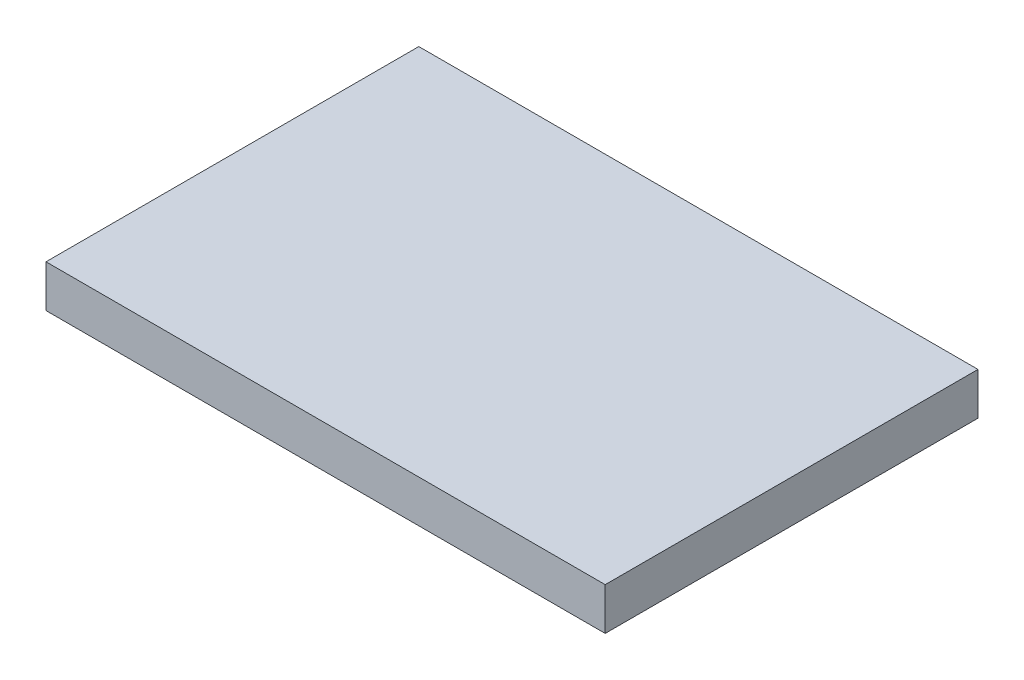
ISO-10303-21;
HEADER;
FILE_DESCRIPTION(('STEP AP214'),'2;1');
FILE_NAME('part.step','',(''),(''),'','','');
FILE_SCHEMA(('AUTOMOTIVE_DESIGN { 1 0 10303 214 1 1 1 1 }'));
ENDSEC;
DATA;
#1=APPLICATION_CONTEXT('core data for automotive mechanical design processes');
#2=APPLICATION_PROTOCOL_DEFINITION('international standard','automotive_design',2000,#1);
#3=PRODUCT_CONTEXT('',#1,'mechanical');
#4=PRODUCT('Part','Part','',(#3));
#5=PRODUCT_RELATED_PRODUCT_CATEGORY('part','',(#4));
#6=PRODUCT_DEFINITION_FORMATION('','',#4);
#7=PRODUCT_DEFINITION_CONTEXT('part definition',#1,'design');
#8=PRODUCT_DEFINITION('design','',#6,#7);
#9=PRODUCT_DEFINITION_SHAPE('','',#8);
#10=(LENGTH_UNIT() NAMED_UNIT(*) SI_UNIT(.MILLI.,.METRE.));
#11=(NAMED_UNIT(*) PLANE_ANGLE_UNIT() SI_UNIT($,.RADIAN.));
#12=(NAMED_UNIT(*) SI_UNIT($,.STERADIAN.) SOLID_ANGLE_UNIT());
#13=UNCERTAINTY_MEASURE_WITH_UNIT(LENGTH_MEASURE(1.E-05),#10,'distance_accuracy_value','');
#14=(GEOMETRIC_REPRESENTATION_CONTEXT(3) GLOBAL_UNCERTAINTY_ASSIGNED_CONTEXT((#13)) GLOBAL_UNIT_ASSIGNED_CONTEXT((#10,
#11,#12)) REPRESENTATION_CONTEXT('',''));
#15=CARTESIAN_POINT('',(0.,0.,0.));
#16=DIRECTION('',(0.,0.,1.));
#17=DIRECTION('',(1.,0.,0.));
#18=AXIS2_PLACEMENT_3D('',#15,#16,#17);
#19=CARTESIAN_POINT('',(0.,6.35,0.));
#20=DIRECTION('',(1.,0.,0.));
#21=DIRECTION('',(0.,0.,-1.));
#22=AXIS2_PLACEMENT_3D('',#19,#20,#21);
#23=PLANE('',#22);
#24=DIRECTION('',(0.,0.,1.));
#25=VECTOR('',#24,1.);
#26=CARTESIAN_POINT('',(0.,0.,0.));
#27=LINE('',#26,#25);
#28=CARTESIAN_POINT('',(0.,0.,-56.));
#29=VERTEX_POINT('',#28);
#30=CARTESIAN_POINT('',(0.,0.,0.));
#31=VERTEX_POINT('',#30);
#32=EDGE_CURVE('E105',#29,#31,#27,.T.);
#33=ORIENTED_EDGE('',*,*,#32,.T.);
#34=DIRECTION('',(0.,-1.,0.));
#35=VECTOR('',#34,1.);
#36=CARTESIAN_POINT('',(0.,6.35,0.));
#37=LINE('',#36,#35);
#38=CARTESIAN_POINT('',(0.,6.35,0.));
#39=VERTEX_POINT('',#38);
#40=EDGE_CURVE('E11',#39,#31,#37,.T.);
#41=ORIENTED_EDGE('',*,*,#40,.F.);
#42=DIRECTION('',(0.,0.,1.));
#43=VECTOR('',#42,1.);
#44=CARTESIAN_POINT('',(0.,6.35,0.));
#45=LINE('',#44,#43);
#46=CARTESIAN_POINT('',(0.,6.35,-56.));
#47=VERTEX_POINT('',#46);
#48=EDGE_CURVE('E89',#47,#39,#45,.T.);
#49=ORIENTED_EDGE('',*,*,#48,.F.);
#50=DIRECTION('',(0.,-1.,0.));
#51=VECTOR('',#50,1.);
#52=CARTESIAN_POINT('',(0.,6.35,-56.));
#53=LINE('',#52,#51);
#54=EDGE_CURVE('E97',#47,#29,#53,.T.);
#55=ORIENTED_EDGE('',*,*,#54,.T.);
#56=EDGE_LOOP('',(#33,#41,#49,#55));
#57=FACE_BOUND('',#56,.T.);
#58=ADVANCED_FACE('F39',(#57),#23,.F.);
#59=CARTESIAN_POINT('',(0.,6.35,0.));
#60=DIRECTION('',(0.,0.,-1.));
#61=DIRECTION('',(-1.,0.,0.));
#62=AXIS2_PLACEMENT_3D('',#59,#60,#61);
#63=PLANE('',#62);
#64=DIRECTION('',(1.,0.,0.));
#65=VECTOR('',#64,1.);
#66=CARTESIAN_POINT('',(0.,0.,0.));
#67=LINE('',#66,#65);
#68=CARTESIAN_POINT('',(84.,0.,0.));
#69=VERTEX_POINT('',#68);
#70=EDGE_CURVE('E92',#31,#69,#67,.T.);
#71=ORIENTED_EDGE('',*,*,#70,.T.);
#72=DIRECTION('',(0.,-1.,0.));
#73=VECTOR('',#72,1.);
#74=CARTESIAN_POINT('',(84.,6.35,0.));
#75=LINE('',#74,#73);
#76=CARTESIAN_POINT('',(84.,6.35,0.));
#77=VERTEX_POINT('',#76);
#78=EDGE_CURVE('E50',#77,#69,#75,.T.);
#79=ORIENTED_EDGE('',*,*,#78,.F.);
#80=DIRECTION('',(1.,0.,0.));
#81=VECTOR('',#80,1.);
#82=CARTESIAN_POINT('',(0.,6.35,0.));
#83=LINE('',#82,#81);
#84=EDGE_CURVE('E82',#39,#77,#83,.T.);
#85=ORIENTED_EDGE('',*,*,#84,.F.);
#86=ORIENTED_EDGE('',*,*,#40,.T.);
#87=EDGE_LOOP('',(#71,#79,#85,#86));
#88=FACE_BOUND('',#87,.T.);
#89=ADVANCED_FACE('F93',(#88),#63,.F.);
#90=CARTESIAN_POINT('',(84.,6.35,0.));
#91=DIRECTION('',(-1.,0.,0.));
#92=DIRECTION('',(0.,0.,1.));
#93=AXIS2_PLACEMENT_3D('',#90,#91,#92);
#94=PLANE('',#93);
#95=DIRECTION('',(0.,0.,-1.));
#96=VECTOR('',#95,1.);
#97=CARTESIAN_POINT('',(84.,0.,0.));
#98=LINE('',#97,#96);
#99=CARTESIAN_POINT('',(84.,0.,-56.));
#100=VERTEX_POINT('',#99);
#101=EDGE_CURVE('E72',#69,#100,#98,.T.);
#102=ORIENTED_EDGE('',*,*,#101,.T.);
#103=DIRECTION('',(0.,-1.,0.));
#104=VECTOR('',#103,1.);
#105=CARTESIAN_POINT('',(84.,6.35,-56.));
#106=LINE('',#105,#104);
#107=CARTESIAN_POINT('',(84.,6.35,-56.));
#108=VERTEX_POINT('',#107);
#109=EDGE_CURVE('E94',#108,#100,#106,.T.);
#110=ORIENTED_EDGE('',*,*,#109,.F.);
#111=DIRECTION('',(0.,0.,-1.));
#112=VECTOR('',#111,1.);
#113=CARTESIAN_POINT('',(84.,6.35,0.));
#114=LINE('',#113,#112);
#115=EDGE_CURVE('E88',#77,#108,#114,.T.);
#116=ORIENTED_EDGE('',*,*,#115,.F.);
#117=ORIENTED_EDGE('',*,*,#78,.T.);
#118=EDGE_LOOP('',(#102,#110,#116,#117));
#119=FACE_BOUND('',#118,.T.);
#120=ADVANCED_FACE('F96',(#119),#94,.F.);
#121=CARTESIAN_POINT('',(0.,6.35,-56.));
#122=DIRECTION('',(0.,0.,1.));
#123=DIRECTION('',(1.,0.,0.));
#124=AXIS2_PLACEMENT_3D('',#121,#122,#123);
#125=PLANE('',#124);
#126=DIRECTION('',(-1.,0.,0.));
#127=VECTOR('',#126,1.);
#128=CARTESIAN_POINT('',(0.,0.,-56.));
#129=LINE('',#128,#127);
#130=EDGE_CURVE('E76',#100,#29,#129,.T.);
#131=ORIENTED_EDGE('',*,*,#130,.T.);
#132=ORIENTED_EDGE('',*,*,#54,.F.);
#133=DIRECTION('',(-1.,0.,0.));
#134=VECTOR('',#133,1.);
#135=CARTESIAN_POINT('',(0.,6.35,-56.));
#136=LINE('',#135,#134);
#137=EDGE_CURVE('E54',#108,#47,#136,.T.);
#138=ORIENTED_EDGE('',*,*,#137,.F.);
#139=ORIENTED_EDGE('',*,*,#109,.T.);
#140=EDGE_LOOP('',(#131,#132,#138,#139));
#141=FACE_BOUND('',#140,.T.);
#142=ADVANCED_FACE('F108',(#141),#125,.F.);
#143=CARTESIAN_POINT('',(0.,6.35,0.));
#144=DIRECTION('',(0.,-1.,0.));
#145=DIRECTION('',(0.,0.,-1.));
#146=AXIS2_PLACEMENT_3D('',#143,#144,#145);
#147=PLANE('',#146);
#148=ORIENTED_EDGE('',*,*,#48,.T.);
#149=ORIENTED_EDGE('',*,*,#84,.T.);
#150=ORIENTED_EDGE('',*,*,#115,.T.);
#151=ORIENTED_EDGE('',*,*,#137,.T.);
#152=EDGE_LOOP('',(#148,#149,#150,#151));
#153=FACE_BOUND('',#152,.T.);
#154=ADVANCED_FACE('F86',(#153),#147,.F.);
#155=CARTESIAN_POINT('',(0.,0.,0.));
#156=DIRECTION('',(0.,-1.,0.));
#157=DIRECTION('',(0.,0.,-1.));
#158=AXIS2_PLACEMENT_3D('',#155,#156,#157);
#159=PLANE('',#158);
#160=ORIENTED_EDGE('',*,*,#32,.F.);
#161=ORIENTED_EDGE('',*,*,#130,.F.);
#162=ORIENTED_EDGE('',*,*,#101,.F.);
#163=ORIENTED_EDGE('',*,*,#70,.F.);
#164=EDGE_LOOP('',(#160,#161,#162,#163));
#165=FACE_BOUND('',#164,.T.);
#166=ADVANCED_FACE('F115',(#165),#159,.T.);
#167=CLOSED_SHELL('',(#58,#89,#120,#142,#154,#166));
#168=MANIFOLD_SOLID_BREP('B2',#167);
#169=ADVANCED_BREP_SHAPE_REPRESENTATION('',(#18,#168),#14);
#170=SHAPE_DEFINITION_REPRESENTATION(#9,#169);
ENDSEC;
END-ISO-10303-21;
